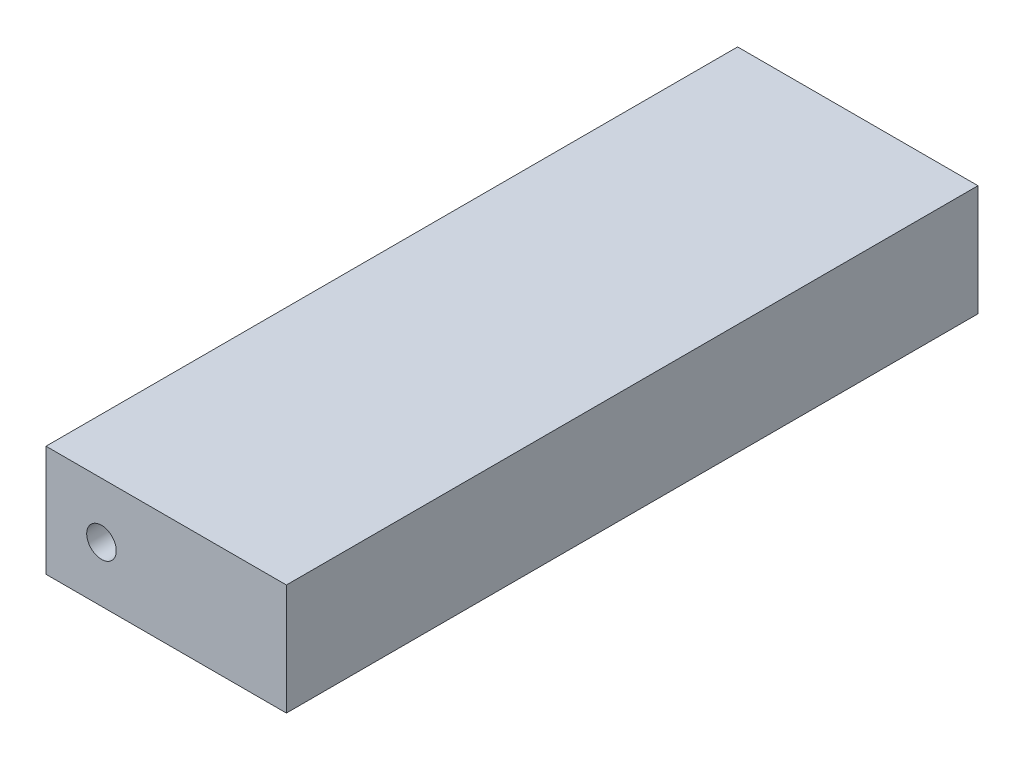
ISO-10303-21;
HEADER;
FILE_DESCRIPTION(('STEP AP214'),'2;1');
FILE_NAME('part.step','',(''),(''),'','','');
FILE_SCHEMA(('AUTOMOTIVE_DESIGN { 1 0 10303 214 1 1 1 1 }'));
ENDSEC;
DATA;
#1=APPLICATION_CONTEXT('core data for automotive mechanical design processes');
#2=APPLICATION_PROTOCOL_DEFINITION('international standard','automotive_design',2000,#1);
#3=PRODUCT_CONTEXT('',#1,'mechanical');
#4=PRODUCT('Part','Part','',(#3));
#5=PRODUCT_RELATED_PRODUCT_CATEGORY('part','',(#4));
#6=PRODUCT_DEFINITION_FORMATION('','',#4);
#7=PRODUCT_DEFINITION_CONTEXT('part definition',#1,'design');
#8=PRODUCT_DEFINITION('design','',#6,#7);
#9=PRODUCT_DEFINITION_SHAPE('','',#8);
#10=(LENGTH_UNIT() NAMED_UNIT(*) SI_UNIT(.MILLI.,.METRE.));
#11=(NAMED_UNIT(*) PLANE_ANGLE_UNIT() SI_UNIT($,.RADIAN.));
#12=(NAMED_UNIT(*) SI_UNIT($,.STERADIAN.) SOLID_ANGLE_UNIT());
#13=UNCERTAINTY_MEASURE_WITH_UNIT(LENGTH_MEASURE(1.E-05),#10,'distance_accuracy_value','');
#14=(GEOMETRIC_REPRESENTATION_CONTEXT(3) GLOBAL_UNCERTAINTY_ASSIGNED_CONTEXT((#13)) GLOBAL_UNIT_ASSIGNED_CONTEXT((#10,
#11,#12)) REPRESENTATION_CONTEXT('',''));
#15=CARTESIAN_POINT('',(0.,0.,0.));
#16=DIRECTION('',(0.,0.,1.));
#17=DIRECTION('',(1.,0.,0.));
#18=AXIS2_PLACEMENT_3D('',#15,#16,#17);
#19=CARTESIAN_POINT('',(0.,0.,187.));
#20=DIRECTION('',(1.,0.,0.));
#21=DIRECTION('',(0.,0.,-1.));
#22=AXIS2_PLACEMENT_3D('',#19,#20,#21);
#23=PLANE('',#22);
#24=DIRECTION('',(0.,-1.,0.));
#25=VECTOR('',#24,1.);
#26=CARTESIAN_POINT('',(0.,0.,0.));
#27=LINE('',#26,#25);
#28=CARTESIAN_POINT('',(0.,30.,0.));
#29=VERTEX_POINT('',#28);
#30=CARTESIAN_POINT('',(0.,0.,0.));
#31=VERTEX_POINT('',#30);
#32=EDGE_CURVE('E70',#29,#31,#27,.T.);
#33=ORIENTED_EDGE('',*,*,#32,.T.);
#34=DIRECTION('',(0.,0.,-1.));
#35=VECTOR('',#34,1.);
#36=CARTESIAN_POINT('',(0.,0.,187.));
#37=LINE('',#36,#35);
#38=CARTESIAN_POINT('',(0.,0.,187.));
#39=VERTEX_POINT('',#38);
#40=EDGE_CURVE('E11',#39,#31,#37,.T.);
#41=ORIENTED_EDGE('',*,*,#40,.F.);
#42=DIRECTION('',(0.,-1.,0.));
#43=VECTOR('',#42,1.);
#44=CARTESIAN_POINT('',(0.,0.,187.));
#45=LINE('',#44,#43);
#46=CARTESIAN_POINT('',(0.,30.,187.));
#47=VERTEX_POINT('',#46);
#48=EDGE_CURVE('E93',#47,#39,#45,.T.);
#49=ORIENTED_EDGE('',*,*,#48,.F.);
#50=DIRECTION('',(0.,0.,-1.));
#51=VECTOR('',#50,1.);
#52=CARTESIAN_POINT('',(0.,30.,187.));
#53=LINE('',#52,#51);
#54=EDGE_CURVE('E82',#47,#29,#53,.T.);
#55=ORIENTED_EDGE('',*,*,#54,.T.);
#56=EDGE_LOOP('',(#33,#41,#49,#55));
#57=FACE_BOUND('',#56,.T.);
#58=ADVANCED_FACE('F26',(#57),#23,.F.);
#59=CARTESIAN_POINT('',(0.,0.,187.));
#60=DIRECTION('',(0.,1.,0.));
#61=DIRECTION('',(0.,0.,1.));
#62=AXIS2_PLACEMENT_3D('',#59,#60,#61);
#63=PLANE('',#62);
#64=DIRECTION('',(1.,0.,0.));
#65=VECTOR('',#64,1.);
#66=CARTESIAN_POINT('',(0.,0.,0.));
#67=LINE('',#66,#65);
#68=CARTESIAN_POINT('',(65.,0.,0.));
#69=VERTEX_POINT('',#68);
#70=EDGE_CURVE('E66',#31,#69,#67,.T.);
#71=ORIENTED_EDGE('',*,*,#70,.T.);
#72=DIRECTION('',(0.,0.,-1.));
#73=VECTOR('',#72,1.);
#74=CARTESIAN_POINT('',(65.,0.,187.));
#75=LINE('',#74,#73);
#76=CARTESIAN_POINT('',(65.,0.,187.));
#77=VERTEX_POINT('',#76);
#78=EDGE_CURVE('E33',#77,#69,#75,.T.);
#79=ORIENTED_EDGE('',*,*,#78,.F.);
#80=DIRECTION('',(1.,0.,0.));
#81=VECTOR('',#80,1.);
#82=CARTESIAN_POINT('',(0.,0.,187.));
#83=LINE('',#82,#81);
#84=EDGE_CURVE('E78',#39,#77,#83,.T.);
#85=ORIENTED_EDGE('',*,*,#84,.F.);
#86=ORIENTED_EDGE('',*,*,#40,.T.);
#87=EDGE_LOOP('',(#71,#79,#85,#86));
#88=FACE_BOUND('',#87,.T.);
#89=ADVANCED_FACE('F77',(#88),#63,.F.);
#90=CARTESIAN_POINT('',(65.,0.,187.));
#91=DIRECTION('',(-1.,0.,0.));
#92=DIRECTION('',(0.,0.,1.));
#93=AXIS2_PLACEMENT_3D('',#90,#91,#92);
#94=PLANE('',#93);
#95=DIRECTION('',(0.,1.,0.));
#96=VECTOR('',#95,1.);
#97=CARTESIAN_POINT('',(65.,0.,0.));
#98=LINE('',#97,#96);
#99=CARTESIAN_POINT('',(65.,30.,0.));
#100=VERTEX_POINT('',#99);
#101=EDGE_CURVE('E71',#69,#100,#98,.T.);
#102=ORIENTED_EDGE('',*,*,#101,.T.);
#103=DIRECTION('',(0.,0.,-1.));
#104=VECTOR('',#103,1.);
#105=CARTESIAN_POINT('',(65.,30.,187.));
#106=LINE('',#105,#104);
#107=CARTESIAN_POINT('',(65.,30.,187.));
#108=VERTEX_POINT('',#107);
#109=EDGE_CURVE('E99',#108,#100,#106,.T.);
#110=ORIENTED_EDGE('',*,*,#109,.F.);
#111=DIRECTION('',(0.,1.,0.));
#112=VECTOR('',#111,1.);
#113=CARTESIAN_POINT('',(65.,0.,187.));
#114=LINE('',#113,#112);
#115=EDGE_CURVE('E45',#77,#108,#114,.T.);
#116=ORIENTED_EDGE('',*,*,#115,.F.);
#117=ORIENTED_EDGE('',*,*,#78,.T.);
#118=EDGE_LOOP('',(#102,#110,#116,#117));
#119=FACE_BOUND('',#118,.T.);
#120=ADVANCED_FACE('F102',(#119),#94,.F.);
#121=CARTESIAN_POINT('',(0.,30.,187.));
#122=DIRECTION('',(0.,-1.,0.));
#123=DIRECTION('',(0.,0.,-1.));
#124=AXIS2_PLACEMENT_3D('',#121,#122,#123);
#125=PLANE('',#124);
#126=DIRECTION('',(-1.,0.,0.));
#127=VECTOR('',#126,1.);
#128=CARTESIAN_POINT('',(0.,30.,0.));
#129=LINE('',#128,#127);
#130=EDGE_CURVE('E91',#100,#29,#129,.T.);
#131=ORIENTED_EDGE('',*,*,#130,.T.);
#132=ORIENTED_EDGE('',*,*,#54,.F.);
#133=DIRECTION('',(-1.,0.,0.));
#134=VECTOR('',#133,1.);
#135=CARTESIAN_POINT('',(0.,30.,187.));
#136=LINE('',#135,#134);
#137=EDGE_CURVE('E40',#108,#47,#136,.T.);
#138=ORIENTED_EDGE('',*,*,#137,.F.);
#139=ORIENTED_EDGE('',*,*,#109,.T.);
#140=EDGE_LOOP('',(#131,#132,#138,#139));
#141=FACE_BOUND('',#140,.T.);
#142=ADVANCED_FACE('F104',(#141),#125,.F.);
#143=CARTESIAN_POINT('',(0.,30.,187.));
#144=DIRECTION('',(0.,0.,-1.));
#145=DIRECTION('',(-1.,0.,0.));
#146=AXIS2_PLACEMENT_3D('',#143,#144,#145);
#147=PLANE('',#146);
#148=CARTESIAN_POINT('',(15.0000000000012,14.9999999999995,187.));
#149=DIRECTION('',(0.,0.,-1.));
#150=DIRECTION('',(-1.,0.,0.));
#151=AXIS2_PLACEMENT_3D('',#148,#149,#150);
#152=CIRCLE('',#151,4.);
#153=CARTESIAN_POINT('',(11.0000000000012,14.9999999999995,187.));
#154=VERTEX_POINT('',#153);
#155=EDGE_CURVE('E83',#154,#154,#152,.T.);
#156=ORIENTED_EDGE('',*,*,#155,.T.);
#157=EDGE_LOOP('',(#156));
#158=FACE_BOUND('',#157,.T.);
#159=ORIENTED_EDGE('',*,*,#48,.T.);
#160=ORIENTED_EDGE('',*,*,#84,.T.);
#161=ORIENTED_EDGE('',*,*,#115,.T.);
#162=ORIENTED_EDGE('',*,*,#137,.T.);
#163=EDGE_LOOP('',(#159,#160,#161,#162));
#164=FACE_BOUND('',#163,.T.);
#165=ADVANCED_FACE('F105',(#158,#164),#147,.F.);
#166=CARTESIAN_POINT('',(0.,30.,0.));
#167=DIRECTION('',(0.,0.,-1.));
#168=DIRECTION('',(-1.,0.,0.));
#169=AXIS2_PLACEMENT_3D('',#166,#167,#168);
#170=PLANE('',#169);
#171=CARTESIAN_POINT('',(15.0000000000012,14.9999999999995,0.));
#172=DIRECTION('',(0.,0.,-1.));
#173=DIRECTION('',(-1.,0.,0.));
#174=AXIS2_PLACEMENT_3D('',#171,#172,#173);
#175=CIRCLE('',#174,4.);
#176=CARTESIAN_POINT('',(11.0000000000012,14.9999999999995,0.));
#177=VERTEX_POINT('',#176);
#178=EDGE_CURVE('E86',#177,#177,#175,.T.);
#179=ORIENTED_EDGE('',*,*,#178,.F.);
#180=EDGE_LOOP('',(#179));
#181=FACE_BOUND('',#180,.T.);
#182=ORIENTED_EDGE('',*,*,#32,.F.);
#183=ORIENTED_EDGE('',*,*,#130,.F.);
#184=ORIENTED_EDGE('',*,*,#101,.F.);
#185=ORIENTED_EDGE('',*,*,#70,.F.);
#186=EDGE_LOOP('',(#182,#183,#184,#185));
#187=FACE_BOUND('',#186,.T.);
#188=ADVANCED_FACE('F67',(#181,#187),#170,.T.);
#189=CARTESIAN_POINT('',(15.0000000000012,14.9999999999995,187.));
#190=DIRECTION('',(0.,0.,-1.));
#191=DIRECTION('',(-1.,0.,0.));
#192=AXIS2_PLACEMENT_3D('',#189,#190,#191);
#193=CYLINDRICAL_SURFACE('',#192,4.);
#194=ORIENTED_EDGE('',*,*,#155,.F.);
#195=EDGE_LOOP('',(#194));
#196=FACE_BOUND('',#195,.T.);
#197=ORIENTED_EDGE('',*,*,#178,.T.);
#198=EDGE_LOOP('',(#197));
#199=FACE_BOUND('',#198,.T.);
#200=ADVANCED_FACE('F113',(#196,#199),#193,.F.);
#201=CLOSED_SHELL('',(#58,#89,#120,#142,#165,#188,#200));
#202=MANIFOLD_SOLID_BREP('B2',#201);
#203=ADVANCED_BREP_SHAPE_REPRESENTATION('',(#18,#202),#14);
#204=SHAPE_DEFINITION_REPRESENTATION(#9,#203);
ENDSEC;
END-ISO-10303-21;
